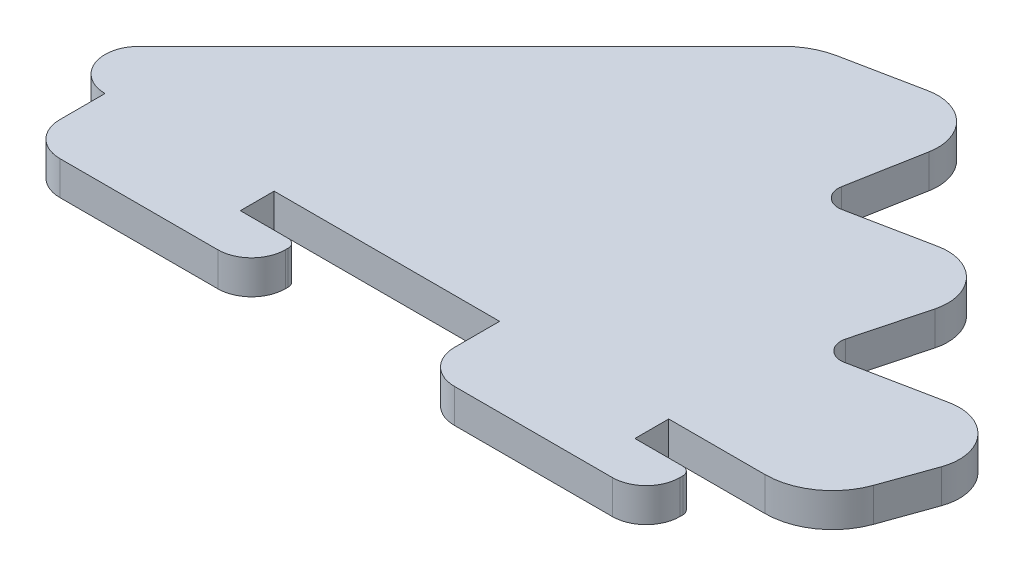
ISO-10303-21;
HEADER;
FILE_DESCRIPTION(('STEP AP214'),'2;1');
FILE_NAME('part.step','',(''),(''),'','','');
FILE_SCHEMA(('AUTOMOTIVE_DESIGN { 1 0 10303 214 1 1 1 1 }'));
ENDSEC;
DATA;
#1=APPLICATION_CONTEXT('core data for automotive mechanical design processes');
#2=APPLICATION_PROTOCOL_DEFINITION('international standard','automotive_design',2000,#1);
#3=PRODUCT_CONTEXT('',#1,'mechanical');
#4=PRODUCT('Part','Part','',(#3));
#5=PRODUCT_RELATED_PRODUCT_CATEGORY('part','',(#4));
#6=PRODUCT_DEFINITION_FORMATION('','',#4);
#7=PRODUCT_DEFINITION_CONTEXT('part definition',#1,'design');
#8=PRODUCT_DEFINITION('design','',#6,#7);
#9=PRODUCT_DEFINITION_SHAPE('','',#8);
#10=(LENGTH_UNIT() NAMED_UNIT(*) SI_UNIT(.MILLI.,.METRE.));
#11=(NAMED_UNIT(*) PLANE_ANGLE_UNIT() SI_UNIT($,.RADIAN.));
#12=(NAMED_UNIT(*) SI_UNIT($,.STERADIAN.) SOLID_ANGLE_UNIT());
#13=UNCERTAINTY_MEASURE_WITH_UNIT(LENGTH_MEASURE(1.E-05),#10,'distance_accuracy_value','');
#14=(GEOMETRIC_REPRESENTATION_CONTEXT(3) GLOBAL_UNCERTAINTY_ASSIGNED_CONTEXT((#13)) GLOBAL_UNIT_ASSIGNED_CONTEXT((#10,
#11,#12)) REPRESENTATION_CONTEXT('',''));
#15=CARTESIAN_POINT('',(0.,0.,0.));
#16=DIRECTION('',(0.,0.,1.));
#17=DIRECTION('',(1.,0.,0.));
#18=AXIS2_PLACEMENT_3D('',#15,#16,#17);
#19=CARTESIAN_POINT('',(69.2418774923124,3.,-9.7772198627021));
#20=DIRECTION('',(0.,-1.,0.));
#21=DIRECTION('',(0.,0.,-1.));
#22=AXIS2_PLACEMENT_3D('',#19,#20,#21);
#23=CYLINDRICAL_SURFACE('',#22,4.00000000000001);
#24=CARTESIAN_POINT('',(69.2418774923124,0.,-9.7772198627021));
#25=DIRECTION('',(0.,1.,0.));
#26=DIRECTION('',(0.,0.,-1.));
#27=AXIS2_PLACEMENT_3D('',#24,#25,#26);
#28=CIRCLE('',#27,4.00000000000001);
#29=CARTESIAN_POINT('',(73.0092042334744,0.,-8.43288016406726));
#30=VERTEX_POINT('',#29);
#31=CARTESIAN_POINT('',(68.4538781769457,0.,-13.6988339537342));
#32=VERTEX_POINT('',#31);
#33=EDGE_CURVE('E279',#30,#32,#28,.T.);
#34=ORIENTED_EDGE('',*,*,#33,.T.);
#35=DIRECTION('',(0.,-1.,0.));
#36=VECTOR('',#35,1.);
#37=CARTESIAN_POINT('',(68.4538781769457,3.,-13.6988339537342));
#38=LINE('',#37,#36);
#39=CARTESIAN_POINT('',(68.4538781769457,3.,-13.6988339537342));
#40=VERTEX_POINT('',#39);
#41=EDGE_CURVE('E258',#40,#32,#38,.T.);
#42=ORIENTED_EDGE('',*,*,#41,.F.);
#43=CARTESIAN_POINT('',(69.2418774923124,3.,-9.7772198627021));
#44=DIRECTION('',(0.,1.,0.));
#45=DIRECTION('',(0.,0.,-1.));
#46=AXIS2_PLACEMENT_3D('',#43,#44,#45);
#47=CIRCLE('',#46,4.00000000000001);
#48=CARTESIAN_POINT('',(73.0092042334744,3.,-8.43288016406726));
#49=VERTEX_POINT('',#48);
#50=EDGE_CURVE('E265',#49,#40,#47,.T.);
#51=ORIENTED_EDGE('',*,*,#50,.F.);
#52=DIRECTION('',(0.,-1.,0.));
#53=VECTOR('',#52,1.);
#54=CARTESIAN_POINT('',(73.0092042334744,3.,-8.43288016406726));
#55=LINE('',#54,#53);
#56=EDGE_CURVE('E421',#49,#30,#55,.T.);
#57=ORIENTED_EDGE('',*,*,#56,.T.);
#58=EDGE_LOOP('',(#34,#42,#51,#57));
#59=FACE_BOUND('',#58,.T.);
#60=ADVANCED_FACE('F38',(#59),#23,.T.);
#61=CARTESIAN_POINT('',(60.6919456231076,3.,-12.1391706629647));
#62=DIRECTION('',(0.196999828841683,0.,0.980403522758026));
#63=DIRECTION('',(0.980403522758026,0.,-0.196999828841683));
#64=AXIS2_PLACEMENT_3D('',#61,#62,#63);
#65=PLANE('',#64);
#66=DIRECTION('',(-0.980403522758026,0.,0.196999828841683));
#67=VECTOR('',#66,1.);
#68=CARTESIAN_POINT('',(60.6919456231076,0.,-12.1391706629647));
#69=LINE('',#68,#67);
#70=CARTESIAN_POINT('',(60.6919456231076,0.,-12.1391706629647));
#71=VERTEX_POINT('',#70);
#72=EDGE_CURVE('E513',#32,#71,#69,.T.);
#73=ORIENTED_EDGE('',*,*,#72,.T.);
#74=DIRECTION('',(0.,-1.,0.));
#75=VECTOR('',#74,1.);
#76=CARTESIAN_POINT('',(60.6919456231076,3.,-12.1391706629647));
#77=LINE('',#76,#75);
#78=CARTESIAN_POINT('',(60.6919456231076,3.,-12.1391706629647));
#79=VERTEX_POINT('',#78);
#80=EDGE_CURVE('E261',#79,#71,#77,.T.);
#81=ORIENTED_EDGE('',*,*,#80,.F.);
#82=DIRECTION('',(-0.980403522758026,0.,0.196999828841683));
#83=VECTOR('',#82,1.);
#84=CARTESIAN_POINT('',(60.6919456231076,3.,-12.1391706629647));
#85=LINE('',#84,#83);
#86=EDGE_CURVE('E254',#40,#79,#85,.T.);
#87=ORIENTED_EDGE('',*,*,#86,.F.);
#88=ORIENTED_EDGE('',*,*,#41,.T.);
#89=EDGE_LOOP('',(#73,#81,#87,#88));
#90=FACE_BOUND('',#89,.T.);
#91=ADVANCED_FACE('F256',(#90),#65,.F.);
#92=CARTESIAN_POINT('',(60.396445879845,3.,-13.6097759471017));
#93=DIRECTION('',(0.,-1.,0.));
#94=DIRECTION('',(0.,0.,-1.));
#95=AXIS2_PLACEMENT_3D('',#92,#93,#94);
#96=CYLINDRICAL_SURFACE('',#95,1.49999999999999);
#97=CARTESIAN_POINT('',(60.396445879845,0.,-13.6097759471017));
#98=DIRECTION('',(0.,-1.,0.));
#99=DIRECTION('',(0.,0.,-1.));
#100=AXIS2_PLACEMENT_3D('',#97,#98,#99);
#101=CIRCLE('',#100,1.49999999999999);
#102=CARTESIAN_POINT('',(58.9457105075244,0.,-13.9910460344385));
#103=VERTEX_POINT('',#102);
#104=EDGE_CURVE('E504',#71,#103,#101,.T.);
#105=ORIENTED_EDGE('',*,*,#104,.T.);
#106=DIRECTION('',(0.,-1.,0.));
#107=VECTOR('',#106,1.);
#108=CARTESIAN_POINT('',(58.9457105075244,3.,-13.9910460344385));
#109=LINE('',#108,#107);
#110=CARTESIAN_POINT('',(58.9457105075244,3.,-13.9910460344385));
#111=VERTEX_POINT('',#110);
#112=EDGE_CURVE('E288',#111,#103,#109,.T.);
#113=ORIENTED_EDGE('',*,*,#112,.F.);
#114=CARTESIAN_POINT('',(60.396445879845,3.,-13.6097759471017));
#115=DIRECTION('',(0.,-1.,0.));
#116=DIRECTION('',(0.,0.,-1.));
#117=AXIS2_PLACEMENT_3D('',#114,#115,#116);
#118=CIRCLE('',#117,1.49999999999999);
#119=EDGE_CURVE('E264',#79,#111,#118,.T.);
#120=ORIENTED_EDGE('',*,*,#119,.F.);
#121=ORIENTED_EDGE('',*,*,#80,.T.);
#122=EDGE_LOOP('',(#105,#113,#120,#121));
#123=FACE_BOUND('',#122,.T.);
#124=ADVANCED_FACE('F596',(#123),#96,.F.);
#125=CARTESIAN_POINT('',(60.5924233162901,3.,-20.2567998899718));
#126=DIRECTION('',(-0.967156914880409,0.,-0.254180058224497));
#127=DIRECTION('',(-0.254180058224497,0.,0.967156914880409));
#128=AXIS2_PLACEMENT_3D('',#125,#126,#127);
#129=PLANE('',#128);
#130=DIRECTION('',(0.254180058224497,0.,-0.967156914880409));
#131=VECTOR('',#130,1.);
#132=CARTESIAN_POINT('',(60.5924233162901,0.,-20.2567998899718));
#133=LINE('',#132,#131);
#134=CARTESIAN_POINT('',(60.5924233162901,0.,-20.2567998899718));
#135=VERTEX_POINT('',#134);
#136=EDGE_CURVE('E499',#103,#135,#133,.T.);
#137=ORIENTED_EDGE('',*,*,#136,.T.);
#138=DIRECTION('',(0.,-1.,0.));
#139=VECTOR('',#138,1.);
#140=CARTESIAN_POINT('',(60.5924233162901,3.,-20.2567998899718));
#141=LINE('',#140,#139);
#142=CARTESIAN_POINT('',(60.5924233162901,3.,-20.2567998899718));
#143=VERTEX_POINT('',#142);
#144=EDGE_CURVE('E488',#143,#135,#141,.T.);
#145=ORIENTED_EDGE('',*,*,#144,.F.);
#146=DIRECTION('',(0.254180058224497,0.,-0.967156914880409));
#147=VECTOR('',#146,1.);
#148=CARTESIAN_POINT('',(60.5924233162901,3.,-20.2567998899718));
#149=LINE('',#148,#147);
#150=EDGE_CURVE('E500',#111,#143,#149,.T.);
#151=ORIENTED_EDGE('',*,*,#150,.F.);
#152=ORIENTED_EDGE('',*,*,#112,.T.);
#153=EDGE_LOOP('',(#137,#145,#151,#152));
#154=FACE_BOUND('',#153,.T.);
#155=ADVANCED_FACE('F497',(#154),#129,.F.);
#156=CARTESIAN_POINT('',(56.7237956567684,3.,-21.2735201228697));
#157=DIRECTION('',(0.,-1.,0.));
#158=DIRECTION('',(0.,0.,-1.));
#159=AXIS2_PLACEMENT_3D('',#156,#157,#158);
#160=CYLINDRICAL_SURFACE('',#159,4.);
#161=CARTESIAN_POINT('',(56.7237956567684,0.,-21.2735201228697));
#162=DIRECTION('',(0.,1.,0.));
#163=DIRECTION('',(0.,0.,-1.));
#164=AXIS2_PLACEMENT_3D('',#161,#162,#163);
#165=CIRCLE('',#164,4.);
#166=CARTESIAN_POINT('',(55.9357963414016,0.,-25.1951342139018));
#167=VERTEX_POINT('',#166);
#168=EDGE_CURVE('E506',#135,#167,#165,.T.);
#169=ORIENTED_EDGE('',*,*,#168,.T.);
#170=DIRECTION('',(0.,-1.,0.));
#171=VECTOR('',#170,1.);
#172=CARTESIAN_POINT('',(55.9357963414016,3.,-25.1951342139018));
#173=LINE('',#172,#171);
#174=CARTESIAN_POINT('',(55.9357963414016,3.,-25.1951342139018));
#175=VERTEX_POINT('',#174);
#176=EDGE_CURVE('E484',#175,#167,#173,.T.);
#177=ORIENTED_EDGE('',*,*,#176,.F.);
#178=CARTESIAN_POINT('',(56.7237956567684,3.,-21.2735201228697));
#179=DIRECTION('',(0.,1.,0.));
#180=DIRECTION('',(0.,0.,-1.));
#181=AXIS2_PLACEMENT_3D('',#178,#179,#180);
#182=CIRCLE('',#181,4.);
#183=EDGE_CURVE('E600',#143,#175,#182,.T.);
#184=ORIENTED_EDGE('',*,*,#183,.F.);
#185=ORIENTED_EDGE('',*,*,#144,.T.);
#186=EDGE_LOOP('',(#169,#177,#184,#185));
#187=FACE_BOUND('',#186,.T.);
#188=ADVANCED_FACE('F658',(#187),#160,.T.);
#189=CARTESIAN_POINT('',(48.8358164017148,3.,-23.7684820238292));
#190=DIRECTION('',(0.196999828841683,0.,0.980403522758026));
#191=DIRECTION('',(0.980403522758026,0.,-0.196999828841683));
#192=AXIS2_PLACEMENT_3D('',#189,#190,#191);
#193=PLANE('',#192);
#194=DIRECTION('',(-0.980403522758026,0.,0.196999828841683));
#195=VECTOR('',#194,1.);
#196=CARTESIAN_POINT('',(48.8358164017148,0.,-23.7684820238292));
#197=LINE('',#196,#195);
#198=CARTESIAN_POINT('',(48.8358164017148,0.,-23.7684820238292));
#199=VERTEX_POINT('',#198);
#200=EDGE_CURVE('E511',#167,#199,#197,.T.);
#201=ORIENTED_EDGE('',*,*,#200,.T.);
#202=DIRECTION('',(0.,-1.,0.));
#203=VECTOR('',#202,1.);
#204=CARTESIAN_POINT('',(48.8358164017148,3.,-23.7684820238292));
#205=LINE('',#204,#203);
#206=CARTESIAN_POINT('',(48.8358164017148,3.,-23.7684820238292));
#207=VERTEX_POINT('',#206);
#208=EDGE_CURVE('E480',#207,#199,#205,.T.);
#209=ORIENTED_EDGE('',*,*,#208,.F.);
#210=DIRECTION('',(-0.980403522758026,0.,0.196999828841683));
#211=VECTOR('',#210,1.);
#212=CARTESIAN_POINT('',(48.8358164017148,3.,-23.7684820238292));
#213=LINE('',#212,#211);
#214=EDGE_CURVE('E605',#175,#207,#213,.T.);
#215=ORIENTED_EDGE('',*,*,#214,.F.);
#216=ORIENTED_EDGE('',*,*,#176,.T.);
#217=EDGE_LOOP('',(#201,#209,#215,#216));
#218=FACE_BOUND('',#217,.T.);
#219=ADVANCED_FACE('F654',(#218),#193,.F.);
#220=CARTESIAN_POINT('',(48.5403166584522,3.,-25.2390873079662));
#221=DIRECTION('',(0.,-1.,0.));
#222=DIRECTION('',(0.,0.,-1.));
#223=AXIS2_PLACEMENT_3D('',#220,#221,#222);
#224=CYLINDRICAL_SURFACE('',#223,1.5);
#225=CARTESIAN_POINT('',(48.5403166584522,0.,-25.2390873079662));
#226=DIRECTION('',(0.,-1.,0.));
#227=DIRECTION('',(0.,0.,1.));
#228=AXIS2_PLACEMENT_3D('',#225,#226,#227);
#229=CIRCLE('',#228,1.5);
#230=CARTESIAN_POINT('',(47.0647336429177,0.,-25.5086327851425));
#231=VERTEX_POINT('',#230);
#232=EDGE_CURVE('E519',#199,#231,#229,.T.);
#233=ORIENTED_EDGE('',*,*,#232,.T.);
#234=DIRECTION('',(0.,-1.,0.));
#235=VECTOR('',#234,1.);
#236=CARTESIAN_POINT('',(47.0647336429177,3.,-25.5086327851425));
#237=LINE('',#236,#235);
#238=CARTESIAN_POINT('',(47.0647336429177,3.,-25.5086327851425));
#239=VERTEX_POINT('',#238);
#240=EDGE_CURVE('E476',#239,#231,#237,.T.);
#241=ORIENTED_EDGE('',*,*,#240,.F.);
#242=CARTESIAN_POINT('',(48.5403166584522,3.,-25.2390873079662));
#243=DIRECTION('',(0.,-1.,0.));
#244=DIRECTION('',(0.,0.,1.));
#245=AXIS2_PLACEMENT_3D('',#242,#243,#244);
#246=CIRCLE('',#245,1.5);
#247=EDGE_CURVE('E608',#207,#239,#246,.T.);
#248=ORIENTED_EDGE('',*,*,#247,.F.);
#249=ORIENTED_EDGE('',*,*,#208,.T.);
#250=EDGE_LOOP('',(#233,#241,#248,#249));
#251=FACE_BOUND('',#250,.T.);
#252=ADVANCED_FACE('F650',(#251),#224,.F.);
#253=CARTESIAN_POINT('',(48.2643803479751,3.,-32.0759041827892));
#254=DIRECTION('',(-0.983722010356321,0.,-0.179696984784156));
#255=DIRECTION('',(-0.179696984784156,0.,0.983722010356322));
#256=AXIS2_PLACEMENT_3D('',#253,#254,#255);
#257=PLANE('',#256);
#258=DIRECTION('',(0.179696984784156,0.,-0.983722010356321));
#259=VECTOR('',#258,1.);
#260=CARTESIAN_POINT('',(48.2643803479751,0.,-32.0759041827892));
#261=LINE('',#260,#259);
#262=CARTESIAN_POINT('',(48.2643803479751,0.,-32.0759041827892));
#263=VERTEX_POINT('',#262);
#264=EDGE_CURVE('E522',#231,#263,#261,.T.);
#265=ORIENTED_EDGE('',*,*,#264,.T.);
#266=DIRECTION('',(0.,-1.,0.));
#267=VECTOR('',#266,1.);
#268=CARTESIAN_POINT('',(48.2643803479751,3.,-32.0759041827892));
#269=LINE('',#268,#267);
#270=CARTESIAN_POINT('',(48.2643803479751,3.,-32.0759041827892));
#271=VERTEX_POINT('',#270);
#272=EDGE_CURVE('E472',#271,#263,#269,.T.);
#273=ORIENTED_EDGE('',*,*,#272,.F.);
#274=DIRECTION('',(0.179696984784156,0.,-0.983722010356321));
#275=VECTOR('',#274,1.);
#276=CARTESIAN_POINT('',(48.2643803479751,3.,-32.0759041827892));
#277=LINE('',#276,#275);
#278=EDGE_CURVE('E611',#239,#271,#277,.T.);
#279=ORIENTED_EDGE('',*,*,#278,.F.);
#280=ORIENTED_EDGE('',*,*,#240,.T.);
#281=EDGE_LOOP('',(#265,#273,#279,#280));
#282=FACE_BOUND('',#281,.T.);
#283=ADVANCED_FACE('F645',(#282),#257,.F.);
#284=CARTESIAN_POINT('',(44.3294923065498,3.,-32.7946921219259));
#285=DIRECTION('',(0.,-1.,0.));
#286=DIRECTION('',(0.,0.,-1.));
#287=AXIS2_PLACEMENT_3D('',#284,#285,#286);
#288=CYLINDRICAL_SURFACE('',#287,4.);
#289=CARTESIAN_POINT('',(44.3294923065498,0.,-32.7946921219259));
#290=DIRECTION('',(0.,1.,0.));
#291=DIRECTION('',(0.,0.,-1.));
#292=AXIS2_PLACEMENT_3D('',#289,#290,#291);
#293=CIRCLE('',#292,4.);
#294=CARTESIAN_POINT('',(43.541492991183,0.,-36.716306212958));
#295=VERTEX_POINT('',#294);
#296=EDGE_CURVE('E525',#263,#295,#293,.T.);
#297=ORIENTED_EDGE('',*,*,#296,.T.);
#298=DIRECTION('',(0.,-1.,0.));
#299=VECTOR('',#298,1.);
#300=CARTESIAN_POINT('',(43.541492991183,3.,-36.716306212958));
#301=LINE('',#300,#299);
#302=CARTESIAN_POINT('',(43.541492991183,3.,-36.716306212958));
#303=VERTEX_POINT('',#302);
#304=EDGE_CURVE('E468',#303,#295,#301,.T.);
#305=ORIENTED_EDGE('',*,*,#304,.F.);
#306=CARTESIAN_POINT('',(44.3294923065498,3.,-32.7946921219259));
#307=DIRECTION('',(0.,1.,0.));
#308=DIRECTION('',(0.,0.,-1.));
#309=AXIS2_PLACEMENT_3D('',#306,#307,#308);
#310=CIRCLE('',#309,4.);
#311=EDGE_CURVE('E614',#271,#303,#310,.T.);
#312=ORIENTED_EDGE('',*,*,#311,.F.);
#313=ORIENTED_EDGE('',*,*,#272,.T.);
#314=EDGE_LOOP('',(#297,#305,#312,#313));
#315=FACE_BOUND('',#314,.T.);
#316=ADVANCED_FACE('F640',(#315),#288,.T.);
#317=CARTESIAN_POINT('',(36.7781603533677,3.,-35.3572990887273));
#318=DIRECTION('',(0.196999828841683,0.,0.980403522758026));
#319=DIRECTION('',(0.980403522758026,0.,-0.196999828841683));
#320=AXIS2_PLACEMENT_3D('',#317,#318,#319);
#321=PLANE('',#320);
#322=DIRECTION('',(-0.980403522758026,0.,0.196999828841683));
#323=VECTOR('',#322,1.);
#324=CARTESIAN_POINT('',(36.7781603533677,0.,-35.3572990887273));
#325=LINE('',#324,#323);
#326=CARTESIAN_POINT('',(36.7781603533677,0.,-35.3572990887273));
#327=VERTEX_POINT('',#326);
#328=EDGE_CURVE('E528',#295,#327,#325,.T.);
#329=ORIENTED_EDGE('',*,*,#328,.T.);
#330=DIRECTION('',(0.,-1.,0.));
#331=VECTOR('',#330,1.);
#332=CARTESIAN_POINT('',(36.7781603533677,3.,-35.3572990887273));
#333=LINE('',#332,#331);
#334=CARTESIAN_POINT('',(36.7781603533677,3.,-35.3572990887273));
#335=VERTEX_POINT('',#334);
#336=EDGE_CURVE('E464',#335,#327,#333,.T.);
#337=ORIENTED_EDGE('',*,*,#336,.F.);
#338=DIRECTION('',(-0.980403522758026,0.,0.196999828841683));
#339=VECTOR('',#338,1.);
#340=CARTESIAN_POINT('',(36.7781603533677,3.,-35.3572990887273));
#341=LINE('',#340,#339);
#342=EDGE_CURVE('E617',#303,#335,#341,.T.);
#343=ORIENTED_EDGE('',*,*,#342,.F.);
#344=ORIENTED_EDGE('',*,*,#304,.T.);
#345=EDGE_LOOP('',(#329,#337,#343,#344));
#346=FACE_BOUND('',#345,.T.);
#347=ADVANCED_FACE('F636',(#346),#321,.F.);
#348=CARTESIAN_POINT('',(37.9601593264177,3.,-29.4748779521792));
#349=DIRECTION('',(0.,-1.,0.));
#350=DIRECTION('',(0.,0.,-1.));
#351=AXIS2_PLACEMENT_3D('',#348,#349,#350);
#352=CYLINDRICAL_SURFACE('',#351,6.);
#353=CARTESIAN_POINT('',(37.9601593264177,0.,-29.4748779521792));
#354=DIRECTION('',(0.,1.,0.));
#355=DIRECTION('',(0.,0.,-1.));
#356=AXIS2_PLACEMENT_3D('',#353,#354,#355);
#357=CIRCLE('',#356,6.);
#358=CARTESIAN_POINT('',(33.7175186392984,0.,-33.7175186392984));
#359=VERTEX_POINT('',#358);
#360=EDGE_CURVE('E531',#327,#359,#357,.T.);
#361=ORIENTED_EDGE('',*,*,#360,.T.);
#362=DIRECTION('',(0.,-1.,0.));
#363=VECTOR('',#362,1.);
#364=CARTESIAN_POINT('',(33.7175186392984,3.,-33.7175186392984));
#365=LINE('',#364,#363);
#366=CARTESIAN_POINT('',(33.7175186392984,3.,-33.7175186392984));
#367=VERTEX_POINT('',#366);
#368=EDGE_CURVE('E460',#367,#359,#365,.T.);
#369=ORIENTED_EDGE('',*,*,#368,.F.);
#370=CARTESIAN_POINT('',(37.9601593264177,3.,-29.4748779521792));
#371=DIRECTION('',(0.,1.,0.));
#372=DIRECTION('',(0.,0.,-1.));
#373=AXIS2_PLACEMENT_3D('',#370,#371,#372);
#374=CIRCLE('',#373,6.);
#375=EDGE_CURVE('E620',#335,#367,#374,.T.);
#376=ORIENTED_EDGE('',*,*,#375,.F.);
#377=ORIENTED_EDGE('',*,*,#336,.T.);
#378=EDGE_LOOP('',(#361,#369,#376,#377));
#379=FACE_BOUND('',#378,.T.);
#380=ADVANCED_FACE('F632',(#379),#352,.T.);
#381=CARTESIAN_POINT('',(33.7175186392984,3.,-33.7175186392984));
#382=DIRECTION('',(0.707106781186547,0.,0.707106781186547));
#383=DIRECTION('',(0.707106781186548,0.,-0.707106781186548));
#384=AXIS2_PLACEMENT_3D('',#381,#382,#383);
#385=PLANE('',#384);
#386=DIRECTION('',(-0.707106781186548,0.,0.707106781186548));
#387=VECTOR('',#386,1.);
#388=CARTESIAN_POINT('',(33.7175186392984,0.,-33.7175186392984));
#389=LINE('',#388,#387);
#390=CARTESIAN_POINT('',(5.12132034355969,0.,-5.12132034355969));
#391=VERTEX_POINT('',#390);
#392=EDGE_CURVE('E534',#359,#391,#389,.T.);
#393=ORIENTED_EDGE('',*,*,#392,.T.);
#394=DIRECTION('',(0.,-1.,0.));
#395=VECTOR('',#394,1.);
#396=CARTESIAN_POINT('',(5.12132034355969,3.,-5.12132034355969));
#397=LINE('',#396,#395);
#398=CARTESIAN_POINT('',(5.12132034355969,3.,-5.12132034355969));
#399=VERTEX_POINT('',#398);
#400=EDGE_CURVE('E456',#399,#391,#397,.T.);
#401=ORIENTED_EDGE('',*,*,#400,.F.);
#402=DIRECTION('',(-0.707106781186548,0.,0.707106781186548));
#403=VECTOR('',#402,1.);
#404=CARTESIAN_POINT('',(33.7175186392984,3.,-33.7175186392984));
#405=LINE('',#404,#403);
#406=EDGE_CURVE('E554',#367,#399,#405,.T.);
#407=ORIENTED_EDGE('',*,*,#406,.F.);
#408=ORIENTED_EDGE('',*,*,#368,.T.);
#409=EDGE_LOOP('',(#393,#401,#407,#408));
#410=FACE_BOUND('',#409,.T.);
#411=ADVANCED_FACE('F627',(#410),#385,.F.);
#412=CARTESIAN_POINT('',(7.24264068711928,3.,-3.));
#413=DIRECTION('',(0.,-1.,0.));
#414=DIRECTION('',(0.,0.,-1.));
#415=AXIS2_PLACEMENT_3D('',#412,#413,#414);
#416=CYLINDRICAL_SURFACE('',#415,3.);
#417=CARTESIAN_POINT('',(7.24264068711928,0.,-3.));
#418=DIRECTION('',(0.,1.,0.));
#419=DIRECTION('',(0.,0.,-1.));
#420=AXIS2_PLACEMENT_3D('',#417,#418,#419);
#421=CIRCLE('',#420,3.);
#422=CARTESIAN_POINT('',(7.24264068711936,0.,0.));
#423=VERTEX_POINT('',#422);
#424=EDGE_CURVE('E383',#391,#423,#421,.T.);
#425=ORIENTED_EDGE('',*,*,#424,.T.);
#426=DIRECTION('',(0.,-1.,0.));
#427=VECTOR('',#426,1.);
#428=CARTESIAN_POINT('',(7.24264068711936,3.,0.));
#429=LINE('',#428,#427);
#430=CARTESIAN_POINT('',(7.24264068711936,3.,0.));
#431=VERTEX_POINT('',#430);
#432=EDGE_CURVE('E452',#431,#423,#429,.T.);
#433=ORIENTED_EDGE('',*,*,#432,.F.);
#434=CARTESIAN_POINT('',(7.24264068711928,3.,-3.));
#435=DIRECTION('',(0.,1.,0.));
#436=DIRECTION('',(0.,0.,-1.));
#437=AXIS2_PLACEMENT_3D('',#434,#435,#436);
#438=CIRCLE('',#437,3.);
#439=EDGE_CURVE('E548',#399,#431,#438,.T.);
#440=ORIENTED_EDGE('',*,*,#439,.F.);
#441=ORIENTED_EDGE('',*,*,#400,.T.);
#442=EDGE_LOOP('',(#425,#433,#440,#441));
#443=FACE_BOUND('',#442,.T.);
#444=ADVANCED_FACE('F541',(#443),#416,.T.);
#445=CARTESIAN_POINT('',(7.24264068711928,3.,3.));
#446=DIRECTION('',(1.,0.,0.));
#447=DIRECTION('',(0.,0.,-1.));
#448=AXIS2_PLACEMENT_3D('',#445,#446,#447);
#449=PLANE('',#448);
#450=DIRECTION('',(0.,0.,1.));
#451=VECTOR('',#450,1.);
#452=CARTESIAN_POINT('',(7.24264068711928,0.,3.));
#453=LINE('',#452,#451);
#454=CARTESIAN_POINT('',(7.24264068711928,0.,4.));
#455=VERTEX_POINT('',#454);
#456=EDGE_CURVE('E376',#423,#455,#453,.T.);
#457=ORIENTED_EDGE('',*,*,#456,.T.);
#458=DIRECTION('',(0.,-1.,0.));
#459=VECTOR('',#458,1.);
#460=CARTESIAN_POINT('',(7.24264068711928,3.,4.));
#461=LINE('',#460,#459);
#462=CARTESIAN_POINT('',(7.24264068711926,3.,4.));
#463=VERTEX_POINT('',#462);
#464=EDGE_CURVE('E11',#455,#463,#461,.F.);
#465=ORIENTED_EDGE('',*,*,#464,.T.);
#466=DIRECTION('',(0.,0.,1.));
#467=VECTOR('',#466,1.);
#468=CARTESIAN_POINT('',(7.24264068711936,3.,0.));
#469=LINE('',#468,#467);
#470=EDGE_CURVE('E546',#431,#463,#469,.T.);
#471=ORIENTED_EDGE('',*,*,#470,.F.);
#472=ORIENTED_EDGE('',*,*,#432,.T.);
#473=EDGE_LOOP('',(#457,#465,#471,#472));
#474=FACE_BOUND('',#473,.T.);
#475=ADVANCED_FACE('F545',(#474),#449,.F.);
#476=CARTESIAN_POINT('',(7.24264068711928,3.,7.));
#477=DIRECTION('',(0.,0.,-1.));
#478=DIRECTION('',(-1.,0.,0.));
#479=AXIS2_PLACEMENT_3D('',#476,#477,#478);
#480=PLANE('',#479);
#481=DIRECTION('',(1.,0.,0.));
#482=VECTOR('',#481,1.);
#483=CARTESIAN_POINT('',(7.24264068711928,3.,7.));
#484=LINE('',#483,#482);
#485=CARTESIAN_POINT('',(10.2426406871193,3.,7.));
#486=VERTEX_POINT('',#485);
#487=CARTESIAN_POINT('',(24.2426406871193,3.,7.));
#488=VERTEX_POINT('',#487);
#489=EDGE_CURVE('E367',#486,#488,#484,.T.);
#490=ORIENTED_EDGE('',*,*,#489,.F.);
#491=DIRECTION('',(0.,-1.,0.));
#492=VECTOR('',#491,1.);
#493=CARTESIAN_POINT('',(10.2426406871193,3.,7.));
#494=LINE('',#493,#492);
#495=CARTESIAN_POINT('',(10.2426406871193,0.,7.));
#496=VERTEX_POINT('',#495);
#497=EDGE_CURVE('E47',#486,#496,#494,.T.);
#498=ORIENTED_EDGE('',*,*,#497,.T.);
#499=DIRECTION('',(1.,0.,0.));
#500=VECTOR('',#499,1.);
#501=CARTESIAN_POINT('',(7.24264068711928,0.,7.));
#502=LINE('',#501,#500);
#503=CARTESIAN_POINT('',(24.2426406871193,0.,7.));
#504=VERTEX_POINT('',#503);
#505=EDGE_CURVE('E366',#496,#504,#502,.T.);
#506=ORIENTED_EDGE('',*,*,#505,.T.);
#507=DIRECTION('',(0.,-1.,0.));
#508=VECTOR('',#507,1.);
#509=CARTESIAN_POINT('',(24.2426406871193,3.,7.));
#510=LINE('',#509,#508);
#511=EDGE_CURVE('E313',#504,#488,#510,.F.);
#512=ORIENTED_EDGE('',*,*,#511,.T.);
#513=EDGE_LOOP('',(#490,#498,#506,#512));
#514=FACE_BOUND('',#513,.T.);
#515=ADVANCED_FACE('F365',(#514),#480,.F.);
#516=CARTESIAN_POINT('',(27.2426406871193,3.,3.));
#517=DIRECTION('',(-1.,0.,0.));
#518=DIRECTION('',(0.,0.,1.));
#519=AXIS2_PLACEMENT_3D('',#516,#517,#518);
#520=PLANE('',#519);
#521=DIRECTION('',(0.,0.,-1.));
#522=VECTOR('',#521,1.);
#523=CARTESIAN_POINT('',(27.2426406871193,0.,3.));
#524=LINE('',#523,#522);
#525=CARTESIAN_POINT('',(27.2426406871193,0.,4.));
#526=VERTEX_POINT('',#525);
#527=CARTESIAN_POINT('',(27.2426406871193,0.,3.75));
#528=VERTEX_POINT('',#527);
#529=EDGE_CURVE('E375',#526,#528,#524,.T.);
#530=ORIENTED_EDGE('',*,*,#529,.T.);
#531=DIRECTION('',(0.,-1.,0.));
#532=VECTOR('',#531,1.);
#533=CARTESIAN_POINT('',(27.2426406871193,3.,3.75));
#534=LINE('',#533,#532);
#535=CARTESIAN_POINT('',(27.2426406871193,3.,3.75));
#536=VERTEX_POINT('',#535);
#537=EDGE_CURVE('E340',#528,#536,#534,.F.);
#538=ORIENTED_EDGE('',*,*,#537,.T.);
#539=DIRECTION('',(0.,0.,-1.));
#540=VECTOR('',#539,1.);
#541=CARTESIAN_POINT('',(27.2426406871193,3.,3.));
#542=LINE('',#541,#540);
#543=CARTESIAN_POINT('',(27.2426406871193,3.,4.));
#544=VERTEX_POINT('',#543);
#545=EDGE_CURVE('E552',#544,#536,#542,.T.);
#546=ORIENTED_EDGE('',*,*,#545,.F.);
#547=DIRECTION('',(0.,-1.,0.));
#548=VECTOR('',#547,1.);
#549=CARTESIAN_POINT('',(27.2426406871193,3.,4.));
#550=LINE('',#549,#548);
#551=EDGE_CURVE('E309',#544,#526,#550,.T.);
#552=ORIENTED_EDGE('',*,*,#551,.T.);
#553=EDGE_LOOP('',(#530,#538,#546,#552));
#554=FACE_BOUND('',#553,.T.);
#555=ADVANCED_FACE('F757',(#554),#520,.F.);
#556=CARTESIAN_POINT('',(22.2426406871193,3.,3.));
#557=DIRECTION('',(0.,0.,1.));
#558=DIRECTION('',(1.,0.,0.));
#559=AXIS2_PLACEMENT_3D('',#556,#557,#558);
#560=PLANE('',#559);
#561=DIRECTION('',(-1.,0.,0.));
#562=VECTOR('',#561,1.);
#563=CARTESIAN_POINT('',(22.2426406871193,3.,3.));
#564=LINE('',#563,#562);
#565=CARTESIAN_POINT('',(26.4926406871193,3.,3.));
#566=VERTEX_POINT('',#565);
#567=CARTESIAN_POINT('',(22.2426406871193,3.,3.));
#568=VERTEX_POINT('',#567);
#569=EDGE_CURVE('E561',#566,#568,#564,.T.);
#570=ORIENTED_EDGE('',*,*,#569,.F.);
#571=DIRECTION('',(0.,-1.,0.));
#572=VECTOR('',#571,1.);
#573=CARTESIAN_POINT('',(26.4926406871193,3.,3.));
#574=LINE('',#573,#572);
#575=CARTESIAN_POINT('',(26.4926406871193,0.,3.));
#576=VERTEX_POINT('',#575);
#577=EDGE_CURVE('E336',#566,#576,#574,.T.);
#578=ORIENTED_EDGE('',*,*,#577,.T.);
#579=DIRECTION('',(-1.,0.,0.));
#580=VECTOR('',#579,1.);
#581=CARTESIAN_POINT('',(22.2426406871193,0.,3.));
#582=LINE('',#581,#580);
#583=CARTESIAN_POINT('',(22.2426406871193,0.,3.));
#584=VERTEX_POINT('',#583);
#585=EDGE_CURVE('E381',#576,#584,#582,.T.);
#586=ORIENTED_EDGE('',*,*,#585,.T.);
#587=DIRECTION('',(0.,-1.,0.));
#588=VECTOR('',#587,1.);
#589=CARTESIAN_POINT('',(22.2426406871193,3.,3.));
#590=LINE('',#589,#588);
#591=EDGE_CURVE('E448',#568,#584,#590,.T.);
#592=ORIENTED_EDGE('',*,*,#591,.F.);
#593=EDGE_LOOP('',(#570,#578,#586,#592));
#594=FACE_BOUND('',#593,.T.);
#595=ADVANCED_FACE('F752',(#594),#560,.F.);
#596=CARTESIAN_POINT('',(22.2426406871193,3.,0.));
#597=DIRECTION('',(-1.,0.,0.));
#598=DIRECTION('',(0.,0.,1.));
#599=AXIS2_PLACEMENT_3D('',#596,#597,#598);
#600=PLANE('',#599);
#601=DIRECTION('',(0.,0.,-1.));
#602=VECTOR('',#601,1.);
#603=CARTESIAN_POINT('',(22.2426406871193,0.,0.));
#604=LINE('',#603,#602);
#605=CARTESIAN_POINT('',(22.2426406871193,0.,0.));
#606=VERTEX_POINT('',#605);
#607=EDGE_CURVE('E389',#584,#606,#604,.T.);
#608=ORIENTED_EDGE('',*,*,#607,.T.);
#609=DIRECTION('',(0.,-1.,0.));
#610=VECTOR('',#609,1.);
#611=CARTESIAN_POINT('',(22.2426406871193,3.,0.));
#612=LINE('',#611,#610);
#613=CARTESIAN_POINT('',(22.2426406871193,3.,0.));
#614=VERTEX_POINT('',#613);
#615=EDGE_CURVE('E444',#614,#606,#612,.T.);
#616=ORIENTED_EDGE('',*,*,#615,.F.);
#617=DIRECTION('',(0.,0.,-1.));
#618=VECTOR('',#617,1.);
#619=CARTESIAN_POINT('',(22.2426406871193,3.,0.));
#620=LINE('',#619,#618);
#621=EDGE_CURVE('E564',#568,#614,#620,.T.);
#622=ORIENTED_EDGE('',*,*,#621,.F.);
#623=ORIENTED_EDGE('',*,*,#591,.T.);
#624=EDGE_LOOP('',(#608,#616,#622,#623));
#625=FACE_BOUND('',#624,.T.);
#626=ADVANCED_FACE('F747',(#625),#600,.F.);
#627=CARTESIAN_POINT('',(22.2426406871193,3.,0.));
#628=DIRECTION('',(0.,0.,-1.));
#629=DIRECTION('',(-1.,0.,0.));
#630=AXIS2_PLACEMENT_3D('',#627,#628,#629);
#631=PLANE('',#630);
#632=DIRECTION('',(1.,0.,0.));
#633=VECTOR('',#632,1.);
#634=CARTESIAN_POINT('',(22.2426406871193,0.,0.));
#635=LINE('',#634,#633);
#636=CARTESIAN_POINT('',(42.2426406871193,0.,0.));
#637=VERTEX_POINT('',#636);
#638=EDGE_CURVE('E392',#606,#637,#635,.T.);
#639=ORIENTED_EDGE('',*,*,#638,.T.);
#640=DIRECTION('',(0.,-1.,0.));
#641=VECTOR('',#640,1.);
#642=CARTESIAN_POINT('',(42.2426406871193,3.,0.));
#643=LINE('',#642,#641);
#644=CARTESIAN_POINT('',(42.2426406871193,3.,0.));
#645=VERTEX_POINT('',#644);
#646=EDGE_CURVE('E440',#645,#637,#643,.T.);
#647=ORIENTED_EDGE('',*,*,#646,.F.);
#648=DIRECTION('',(1.,0.,0.));
#649=VECTOR('',#648,1.);
#650=CARTESIAN_POINT('',(22.2426406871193,3.,0.));
#651=LINE('',#650,#649);
#652=EDGE_CURVE('E567',#614,#645,#651,.T.);
#653=ORIENTED_EDGE('',*,*,#652,.F.);
#654=ORIENTED_EDGE('',*,*,#615,.T.);
#655=EDGE_LOOP('',(#639,#647,#653,#654));
#656=FACE_BOUND('',#655,.T.);
#657=ADVANCED_FACE('F742',(#656),#631,.F.);
#658=CARTESIAN_POINT('',(42.2426406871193,3.,3.));
#659=DIRECTION('',(1.,0.,0.));
#660=DIRECTION('',(0.,0.,-1.));
#661=AXIS2_PLACEMENT_3D('',#658,#659,#660);
#662=PLANE('',#661);
#663=DIRECTION('',(0.,0.,1.));
#664=VECTOR('',#663,1.);
#665=CARTESIAN_POINT('',(42.2426406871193,0.,3.));
#666=LINE('',#665,#664);
#667=CARTESIAN_POINT('',(42.2426406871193,0.,4.));
#668=VERTEX_POINT('',#667);
#669=EDGE_CURVE('E396',#637,#668,#666,.T.);
#670=ORIENTED_EDGE('',*,*,#669,.T.);
#671=DIRECTION('',(0.,-1.,0.));
#672=VECTOR('',#671,1.);
#673=CARTESIAN_POINT('',(42.2426406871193,3.,4.));
#674=LINE('',#673,#672);
#675=CARTESIAN_POINT('',(42.2426406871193,3.,4.));
#676=VERTEX_POINT('',#675);
#677=EDGE_CURVE('E353',#668,#676,#674,.F.);
#678=ORIENTED_EDGE('',*,*,#677,.T.);
#679=DIRECTION('',(0.,0.,1.));
#680=VECTOR('',#679,1.);
#681=CARTESIAN_POINT('',(42.2426406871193,3.,0.));
#682=LINE('',#681,#680);
#683=EDGE_CURVE('E570',#645,#676,#682,.T.);
#684=ORIENTED_EDGE('',*,*,#683,.F.);
#685=ORIENTED_EDGE('',*,*,#646,.T.);
#686=EDGE_LOOP('',(#670,#678,#684,#685));
#687=FACE_BOUND('',#686,.T.);
#688=ADVANCED_FACE('F738',(#687),#662,.F.);
#689=CARTESIAN_POINT('',(42.2426406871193,3.,7.));
#690=DIRECTION('',(0.,0.,-1.));
#691=DIRECTION('',(-1.,0.,0.));
#692=AXIS2_PLACEMENT_3D('',#689,#690,#691);
#693=PLANE('',#692);
#694=DIRECTION('',(1.,0.,0.));
#695=VECTOR('',#694,1.);
#696=CARTESIAN_POINT('',(42.2426406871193,3.,7.));
#697=LINE('',#696,#695);
#698=CARTESIAN_POINT('',(45.2426406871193,3.,7.));
#699=VERTEX_POINT('',#698);
#700=CARTESIAN_POINT('',(59.2426406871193,3.,7.));
#701=VERTEX_POINT('',#700);
#702=EDGE_CURVE('E573',#699,#701,#697,.T.);
#703=ORIENTED_EDGE('',*,*,#702,.F.);
#704=DIRECTION('',(0.,-1.,0.));
#705=VECTOR('',#704,1.);
#706=CARTESIAN_POINT('',(45.2426406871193,3.,7.));
#707=LINE('',#706,#705);
#708=CARTESIAN_POINT('',(45.2426406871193,0.,7.));
#709=VERTEX_POINT('',#708);
#710=EDGE_CURVE('E343',#699,#709,#707,.T.);
#711=ORIENTED_EDGE('',*,*,#710,.T.);
#712=DIRECTION('',(1.,0.,0.));
#713=VECTOR('',#712,1.);
#714=CARTESIAN_POINT('',(42.2426406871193,0.,7.));
#715=LINE('',#714,#713);
#716=CARTESIAN_POINT('',(59.2426406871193,0.,7.));
#717=VERTEX_POINT('',#716);
#718=EDGE_CURVE('E400',#709,#717,#715,.T.);
#719=ORIENTED_EDGE('',*,*,#718,.T.);
#720=DIRECTION('',(0.,-1.,0.));
#721=VECTOR('',#720,1.);
#722=CARTESIAN_POINT('',(59.2426406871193,3.,7.));
#723=LINE('',#722,#721);
#724=EDGE_CURVE('E299',#717,#701,#723,.F.);
#725=ORIENTED_EDGE('',*,*,#724,.T.);
#726=EDGE_LOOP('',(#703,#711,#719,#725));
#727=FACE_BOUND('',#726,.T.);
#728=ADVANCED_FACE('F702',(#727),#693,.F.);
#729=CARTESIAN_POINT('',(62.2426406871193,3.,3.));
#730=DIRECTION('',(-1.,0.,0.));
#731=DIRECTION('',(0.,0.,1.));
#732=AXIS2_PLACEMENT_3D('',#729,#730,#731);
#733=PLANE('',#732);
#734=DIRECTION('',(0.,0.,-1.));
#735=VECTOR('',#734,1.);
#736=CARTESIAN_POINT('',(62.2426406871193,0.,3.));
#737=LINE('',#736,#735);
#738=CARTESIAN_POINT('',(62.2426406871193,0.,4.));
#739=VERTEX_POINT('',#738);
#740=CARTESIAN_POINT('',(62.2426406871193,0.,3.75));
#741=VERTEX_POINT('',#740);
#742=EDGE_CURVE('E403',#739,#741,#737,.T.);
#743=ORIENTED_EDGE('',*,*,#742,.T.);
#744=DIRECTION('',(0.,-1.,0.));
#745=VECTOR('',#744,1.);
#746=CARTESIAN_POINT('',(62.2426406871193,3.,3.75));
#747=LINE('',#746,#745);
#748=CARTESIAN_POINT('',(62.2426406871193,3.,3.75));
#749=VERTEX_POINT('',#748);
#750=EDGE_CURVE('E327',#741,#749,#747,.F.);
#751=ORIENTED_EDGE('',*,*,#750,.T.);
#752=DIRECTION('',(0.,0.,-1.));
#753=VECTOR('',#752,1.);
#754=CARTESIAN_POINT('',(62.2426406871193,3.,3.));
#755=LINE('',#754,#753);
#756=CARTESIAN_POINT('',(62.2426406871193,3.,4.));
#757=VERTEX_POINT('',#756);
#758=EDGE_CURVE('E576',#757,#749,#755,.T.);
#759=ORIENTED_EDGE('',*,*,#758,.F.);
#760=DIRECTION('',(0.,-1.,0.));
#761=VECTOR('',#760,1.);
#762=CARTESIAN_POINT('',(62.2426406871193,3.,4.));
#763=LINE('',#762,#761);
#764=EDGE_CURVE('E281',#757,#739,#763,.T.);
#765=ORIENTED_EDGE('',*,*,#764,.T.);
#766=EDGE_LOOP('',(#743,#751,#759,#765));
#767=FACE_BOUND('',#766,.T.);
#768=ADVANCED_FACE('F709',(#767),#733,.F.);
#769=CARTESIAN_POINT('',(57.2426406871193,3.,3.));
#770=DIRECTION('',(0.,0.,1.));
#771=DIRECTION('',(1.,0.,0.));
#772=AXIS2_PLACEMENT_3D('',#769,#770,#771);
#773=PLANE('',#772);
#774=DIRECTION('',(-1.,0.,0.));
#775=VECTOR('',#774,1.);
#776=CARTESIAN_POINT('',(57.2426406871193,3.,3.));
#777=LINE('',#776,#775);
#778=CARTESIAN_POINT('',(61.4926406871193,3.,3.));
#779=VERTEX_POINT('',#778);
#780=CARTESIAN_POINT('',(57.2426406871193,3.,3.));
#781=VERTEX_POINT('',#780);
#782=EDGE_CURVE('E580',#779,#781,#777,.T.);
#783=ORIENTED_EDGE('',*,*,#782,.F.);
#784=DIRECTION('',(0.,-1.,0.));
#785=VECTOR('',#784,1.);
#786=CARTESIAN_POINT('',(61.4926406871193,3.,3.));
#787=LINE('',#786,#785);
#788=CARTESIAN_POINT('',(61.4926406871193,0.,3.));
#789=VERTEX_POINT('',#788);
#790=EDGE_CURVE('E317',#779,#789,#787,.T.);
#791=ORIENTED_EDGE('',*,*,#790,.T.);
#792=DIRECTION('',(-1.,0.,0.));
#793=VECTOR('',#792,1.);
#794=CARTESIAN_POINT('',(57.2426406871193,0.,3.));
#795=LINE('',#794,#793);
#796=CARTESIAN_POINT('',(57.2426406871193,0.,3.));
#797=VERTEX_POINT('',#796);
#798=EDGE_CURVE('E407',#789,#797,#795,.T.);
#799=ORIENTED_EDGE('',*,*,#798,.T.);
#800=DIRECTION('',(0.,-1.,0.));
#801=VECTOR('',#800,1.);
#802=CARTESIAN_POINT('',(57.2426406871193,3.,3.));
#803=LINE('',#802,#801);
#804=EDGE_CURVE('E436',#781,#797,#803,.T.);
#805=ORIENTED_EDGE('',*,*,#804,.F.);
#806=EDGE_LOOP('',(#783,#791,#799,#805));
#807=FACE_BOUND('',#806,.T.);
#808=ADVANCED_FACE('F716',(#807),#773,.F.);
#809=CARTESIAN_POINT('',(57.2426406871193,3.,0.));
#810=DIRECTION('',(-1.,0.,0.));
#811=DIRECTION('',(0.,0.,1.));
#812=AXIS2_PLACEMENT_3D('',#809,#810,#811);
#813=PLANE('',#812);
#814=DIRECTION('',(0.,0.,-1.));
#815=VECTOR('',#814,1.);
#816=CARTESIAN_POINT('',(57.2426406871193,0.,0.));
#817=LINE('',#816,#815);
#818=CARTESIAN_POINT('',(57.2426406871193,0.,0.));
#819=VERTEX_POINT('',#818);
#820=EDGE_CURVE('E410',#797,#819,#817,.T.);
#821=ORIENTED_EDGE('',*,*,#820,.T.);
#822=DIRECTION('',(0.,-1.,0.));
#823=VECTOR('',#822,1.);
#824=CARTESIAN_POINT('',(57.2426406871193,3.,0.));
#825=LINE('',#824,#823);
#826=CARTESIAN_POINT('',(57.2426406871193,3.,0.));
#827=VERTEX_POINT('',#826);
#828=EDGE_CURVE('E432',#827,#819,#825,.T.);
#829=ORIENTED_EDGE('',*,*,#828,.F.);
#830=DIRECTION('',(0.,0.,-1.));
#831=VECTOR('',#830,1.);
#832=CARTESIAN_POINT('',(57.2426406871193,3.,0.));
#833=LINE('',#832,#831);
#834=EDGE_CURVE('E583',#781,#827,#833,.T.);
#835=ORIENTED_EDGE('',*,*,#834,.F.);
#836=ORIENTED_EDGE('',*,*,#804,.T.);
#837=EDGE_LOOP('',(#821,#829,#835,#836));
#838=FACE_BOUND('',#837,.T.);
#839=ADVANCED_FACE('F722',(#838),#813,.F.);
#840=CARTESIAN_POINT('',(57.2426406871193,3.,0.));
#841=DIRECTION('',(0.,0.,-1.));
#842=DIRECTION('',(-1.,0.,0.));
#843=AXIS2_PLACEMENT_3D('',#840,#841,#842);
#844=PLANE('',#843);
#845=DIRECTION('',(1.,0.,0.));
#846=VECTOR('',#845,1.);
#847=CARTESIAN_POINT('',(57.2426406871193,0.,0.));
#848=LINE('',#847,#846);
#849=CARTESIAN_POINT('',(65.7704858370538,0.,0.));
#850=VERTEX_POINT('',#849);
#851=EDGE_CURVE('E413',#819,#850,#848,.T.);
#852=ORIENTED_EDGE('',*,*,#851,.T.);
#853=DIRECTION('',(0.,-1.,0.));
#854=VECTOR('',#853,1.);
#855=CARTESIAN_POINT('',(65.7704858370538,3.,0.));
#856=LINE('',#855,#854);
#857=CARTESIAN_POINT('',(65.7704858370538,3.,0.));
#858=VERTEX_POINT('',#857);
#859=EDGE_CURVE('E428',#858,#850,#856,.T.);
#860=ORIENTED_EDGE('',*,*,#859,.F.);
#861=DIRECTION('',(1.,0.,0.));
#862=VECTOR('',#861,1.);
#863=CARTESIAN_POINT('',(57.2426406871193,3.,0.));
#864=LINE('',#863,#862);
#865=EDGE_CURVE('E586',#827,#858,#864,.T.);
#866=ORIENTED_EDGE('',*,*,#865,.F.);
#867=ORIENTED_EDGE('',*,*,#828,.T.);
#868=EDGE_LOOP('',(#852,#860,#866,#867));
#869=FACE_BOUND('',#868,.T.);
#870=ADVANCED_FACE('F728',(#869),#844,.F.);
#871=CARTESIAN_POINT('',(65.7704858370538,3.,-6.));
#872=DIRECTION('',(0.,-1.,0.));
#873=DIRECTION('',(0.,0.,-1.));
#874=AXIS2_PLACEMENT_3D('',#871,#872,#873);
#875=CYLINDRICAL_SURFACE('',#874,5.99999999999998);
#876=CARTESIAN_POINT('',(65.7704858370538,0.,-6.));
#877=DIRECTION('',(0.,1.,0.));
#878=DIRECTION('',(0.,0.,1.));
#879=AXIS2_PLACEMENT_3D('',#876,#877,#878);
#880=CIRCLE('',#879,5.99999999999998);
#881=CARTESIAN_POINT('',(71.4214759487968,0.,-3.9834904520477));
#882=VERTEX_POINT('',#881);
#883=EDGE_CURVE('E416',#850,#882,#880,.T.);
#884=ORIENTED_EDGE('',*,*,#883,.T.);
#885=DIRECTION('',(0.,-1.,0.));
#886=VECTOR('',#885,1.);
#887=CARTESIAN_POINT('',(71.4214759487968,3.,-3.9834904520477));
#888=LINE('',#887,#886);
#889=CARTESIAN_POINT('',(71.4214759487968,3.,-3.9834904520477));
#890=VERTEX_POINT('',#889);
#891=EDGE_CURVE('E424',#890,#882,#888,.T.);
#892=ORIENTED_EDGE('',*,*,#891,.F.);
#893=CARTESIAN_POINT('',(65.7704858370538,3.,-6.));
#894=DIRECTION('',(0.,1.,0.));
#895=DIRECTION('',(0.,0.,1.));
#896=AXIS2_PLACEMENT_3D('',#893,#894,#895);
#897=CIRCLE('',#896,5.99999999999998);
#898=EDGE_CURVE('E589',#858,#890,#897,.T.);
#899=ORIENTED_EDGE('',*,*,#898,.F.);
#900=ORIENTED_EDGE('',*,*,#859,.T.);
#901=EDGE_LOOP('',(#884,#892,#899,#900));
#902=FACE_BOUND('',#901,.T.);
#903=ADVANCED_FACE('F732',(#902),#875,.T.);
#904=CARTESIAN_POINT('',(73.0092042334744,3.,-8.43288016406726));
#905=DIRECTION('',(-0.9418316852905,0.,-0.336084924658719));
#906=DIRECTION('',(-0.336084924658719,0.,0.9418316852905));
#907=AXIS2_PLACEMENT_3D('',#904,#905,#906);
#908=PLANE('',#907);
#909=DIRECTION('',(0.336084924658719,0.,-0.9418316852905));
#910=VECTOR('',#909,1.);
#911=CARTESIAN_POINT('',(73.0092042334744,0.,-8.43288016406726));
#912=LINE('',#911,#910);
#913=EDGE_CURVE('E276',#882,#30,#912,.T.);
#914=ORIENTED_EDGE('',*,*,#913,.T.);
#915=ORIENTED_EDGE('',*,*,#56,.F.);
#916=DIRECTION('',(0.336084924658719,0.,-0.9418316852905));
#917=VECTOR('',#916,1.);
#918=CARTESIAN_POINT('',(73.0092042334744,3.,-8.43288016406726));
#919=LINE('',#918,#917);
#920=EDGE_CURVE('E271',#890,#49,#919,.T.);
#921=ORIENTED_EDGE('',*,*,#920,.F.);
#922=ORIENTED_EDGE('',*,*,#891,.T.);
#923=EDGE_LOOP('',(#914,#915,#921,#922));
#924=FACE_BOUND('',#923,.T.);
#925=ADVANCED_FACE('F735',(#924),#908,.F.);
#926=CARTESIAN_POINT('',(69.2418774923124,3.,-9.7772198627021));
#927=DIRECTION('',(0.,-1.,0.));
#928=DIRECTION('',(0.,0.,-1.));
#929=AXIS2_PLACEMENT_3D('',#926,#927,#928);
#930=PLANE('',#929);
#931=ORIENTED_EDGE('',*,*,#683,.T.);
#932=CARTESIAN_POINT('',(45.2426406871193,3.,4.));
#933=DIRECTION('',(0.,-1.,0.));
#934=DIRECTION('',(0.,0.,-1.));
#935=AXIS2_PLACEMENT_3D('',#932,#933,#934);
#936=CIRCLE('',#935,3.);
#937=EDGE_CURVE('E358',#676,#699,#936,.F.);
#938=ORIENTED_EDGE('',*,*,#937,.T.);
#939=ORIENTED_EDGE('',*,*,#702,.T.);
#940=CARTESIAN_POINT('',(59.2426406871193,3.,4.));
#941=DIRECTION('',(0.,-1.,0.));
#942=DIRECTION('',(0.,0.,-1.));
#943=AXIS2_PLACEMENT_3D('',#940,#941,#942);
#944=CIRCLE('',#943,3.);
#945=EDGE_CURVE('E306',#701,#757,#944,.F.);
#946=ORIENTED_EDGE('',*,*,#945,.T.);
#947=ORIENTED_EDGE('',*,*,#758,.T.);
#948=CARTESIAN_POINT('',(61.4926406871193,3.,3.75));
#949=DIRECTION('',(0.,-1.,0.));
#950=DIRECTION('',(0.,0.,-1.));
#951=AXIS2_PLACEMENT_3D('',#948,#949,#950);
#952=CIRCLE('',#951,0.75);
#953=EDGE_CURVE('E333',#749,#779,#952,.F.);
#954=ORIENTED_EDGE('',*,*,#953,.T.);
#955=ORIENTED_EDGE('',*,*,#782,.T.);
#956=ORIENTED_EDGE('',*,*,#834,.T.);
#957=ORIENTED_EDGE('',*,*,#865,.T.);
#958=ORIENTED_EDGE('',*,*,#898,.T.);
#959=ORIENTED_EDGE('',*,*,#920,.T.);
#960=ORIENTED_EDGE('',*,*,#50,.T.);
#961=ORIENTED_EDGE('',*,*,#86,.T.);
#962=ORIENTED_EDGE('',*,*,#119,.T.);
#963=ORIENTED_EDGE('',*,*,#150,.T.);
#964=ORIENTED_EDGE('',*,*,#183,.T.);
#965=ORIENTED_EDGE('',*,*,#214,.T.);
#966=ORIENTED_EDGE('',*,*,#247,.T.);
#967=ORIENTED_EDGE('',*,*,#278,.T.);
#968=ORIENTED_EDGE('',*,*,#311,.T.);
#969=ORIENTED_EDGE('',*,*,#342,.T.);
#970=ORIENTED_EDGE('',*,*,#375,.T.);
#971=ORIENTED_EDGE('',*,*,#406,.T.);
#972=ORIENTED_EDGE('',*,*,#439,.T.);
#973=ORIENTED_EDGE('',*,*,#470,.T.);
#974=CARTESIAN_POINT('',(10.2426406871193,3.,4.));
#975=DIRECTION('',(0.,-1.,0.));
#976=DIRECTION('',(0.,0.,-1.));
#977=AXIS2_PLACEMENT_3D('',#974,#975,#976);
#978=CIRCLE('',#977,3.);
#979=EDGE_CURVE('E54',#463,#486,#978,.F.);
#980=ORIENTED_EDGE('',*,*,#979,.T.);
#981=ORIENTED_EDGE('',*,*,#489,.T.);
#982=CARTESIAN_POINT('',(24.2426406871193,3.,4.));
#983=DIRECTION('',(0.,-1.,0.));
#984=DIRECTION('',(0.,0.,-1.));
#985=AXIS2_PLACEMENT_3D('',#982,#983,#984);
#986=CIRCLE('',#985,3.);
#987=EDGE_CURVE('E303',#488,#544,#986,.F.);
#988=ORIENTED_EDGE('',*,*,#987,.T.);
#989=ORIENTED_EDGE('',*,*,#545,.T.);
#990=CARTESIAN_POINT('',(26.4926406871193,3.,3.75));
#991=DIRECTION('',(0.,-1.,0.));
#992=DIRECTION('',(0.,0.,-1.));
#993=AXIS2_PLACEMENT_3D('',#990,#991,#992);
#994=CIRCLE('',#993,0.75);
#995=EDGE_CURVE('E330',#536,#566,#994,.F.);
#996=ORIENTED_EDGE('',*,*,#995,.T.);
#997=ORIENTED_EDGE('',*,*,#569,.T.);
#998=ORIENTED_EDGE('',*,*,#621,.T.);
#999=ORIENTED_EDGE('',*,*,#652,.T.);
#1000=EDGE_LOOP('',(#931,#938,#939,#946,#947,#954,#955,#956,#957,#958,#959,#960,#961,#962,#963,
#964,#965,#966,#967,#968,#969,#970,#971,#972,#973,#980,#981,#988,#989,#996,#997,#998,#999));
#1001=FACE_BOUND('',#1000,.T.);
#1002=ADVANCED_FACE('F269',(#1001),#930,.F.);
#1003=CARTESIAN_POINT('',(69.2418774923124,0.,-9.7772198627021));
#1004=DIRECTION('',(0.,-1.,0.));
#1005=DIRECTION('',(0.,0.,-1.));
#1006=AXIS2_PLACEMENT_3D('',#1003,#1004,#1005);
#1007=PLANE('',#1006);
#1008=ORIENTED_EDGE('',*,*,#718,.F.);
#1009=CARTESIAN_POINT('',(45.2426406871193,0.,4.));
#1010=DIRECTION('',(0.,-1.,0.));
#1011=DIRECTION('',(0.,0.,-1.));
#1012=AXIS2_PLACEMENT_3D('',#1009,#1010,#1011);
#1013=CIRCLE('',#1012,3.);
#1014=EDGE_CURVE('E350',#709,#668,#1013,.T.);
#1015=ORIENTED_EDGE('',*,*,#1014,.T.);
#1016=ORIENTED_EDGE('',*,*,#669,.F.);
#1017=ORIENTED_EDGE('',*,*,#638,.F.);
#1018=ORIENTED_EDGE('',*,*,#607,.F.);
#1019=ORIENTED_EDGE('',*,*,#585,.F.);
#1020=CARTESIAN_POINT('',(26.4926406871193,0.,3.75));
#1021=DIRECTION('',(0.,-1.,0.));
#1022=DIRECTION('',(0.,0.,-1.));
#1023=AXIS2_PLACEMENT_3D('',#1020,#1021,#1022);
#1024=CIRCLE('',#1023,0.75);
#1025=EDGE_CURVE('E321',#576,#528,#1024,.T.);
#1026=ORIENTED_EDGE('',*,*,#1025,.T.);
#1027=ORIENTED_EDGE('',*,*,#529,.F.);
#1028=CARTESIAN_POINT('',(24.2426406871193,0.,4.));
#1029=DIRECTION('',(0.,-1.,0.));
#1030=DIRECTION('',(0.,0.,-1.));
#1031=AXIS2_PLACEMENT_3D('',#1028,#1029,#1030);
#1032=CIRCLE('',#1031,3.);
#1033=EDGE_CURVE('E286',#526,#504,#1032,.T.);
#1034=ORIENTED_EDGE('',*,*,#1033,.T.);
#1035=ORIENTED_EDGE('',*,*,#505,.F.);
#1036=CARTESIAN_POINT('',(10.2426406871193,0.,4.));
#1037=DIRECTION('',(0.,-1.,0.));
#1038=DIRECTION('',(0.,0.,-1.));
#1039=AXIS2_PLACEMENT_3D('',#1036,#1037,#1038);
#1040=CIRCLE('',#1039,3.);
#1041=EDGE_CURVE('E347',#496,#455,#1040,.T.);
#1042=ORIENTED_EDGE('',*,*,#1041,.T.);
#1043=ORIENTED_EDGE('',*,*,#456,.F.);
#1044=ORIENTED_EDGE('',*,*,#424,.F.);
#1045=ORIENTED_EDGE('',*,*,#392,.F.);
#1046=ORIENTED_EDGE('',*,*,#360,.F.);
#1047=ORIENTED_EDGE('',*,*,#328,.F.);
#1048=ORIENTED_EDGE('',*,*,#296,.F.);
#1049=ORIENTED_EDGE('',*,*,#264,.F.);
#1050=ORIENTED_EDGE('',*,*,#232,.F.);
#1051=ORIENTED_EDGE('',*,*,#200,.F.);
#1052=ORIENTED_EDGE('',*,*,#168,.F.);
#1053=ORIENTED_EDGE('',*,*,#136,.F.);
#1054=ORIENTED_EDGE('',*,*,#104,.F.);
#1055=ORIENTED_EDGE('',*,*,#72,.F.);
#1056=ORIENTED_EDGE('',*,*,#33,.F.);
#1057=ORIENTED_EDGE('',*,*,#913,.F.);
#1058=ORIENTED_EDGE('',*,*,#883,.F.);
#1059=ORIENTED_EDGE('',*,*,#851,.F.);
#1060=ORIENTED_EDGE('',*,*,#820,.F.);
#1061=ORIENTED_EDGE('',*,*,#798,.F.);
#1062=CARTESIAN_POINT('',(61.4926406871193,0.,3.75));
#1063=DIRECTION('',(0.,-1.,0.));
#1064=DIRECTION('',(0.,0.,-1.));
#1065=AXIS2_PLACEMENT_3D('',#1062,#1063,#1064);
#1066=CIRCLE('',#1065,0.75);
#1067=EDGE_CURVE('E324',#789,#741,#1066,.T.);
#1068=ORIENTED_EDGE('',*,*,#1067,.T.);
#1069=ORIENTED_EDGE('',*,*,#742,.F.);
#1070=CARTESIAN_POINT('',(59.2426406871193,0.,4.));
#1071=DIRECTION('',(0.,-1.,0.));
#1072=DIRECTION('',(0.,0.,-1.));
#1073=AXIS2_PLACEMENT_3D('',#1070,#1071,#1072);
#1074=CIRCLE('',#1073,3.);
#1075=EDGE_CURVE('E295',#739,#717,#1074,.T.);
#1076=ORIENTED_EDGE('',*,*,#1075,.T.);
#1077=EDGE_LOOP('',(#1008,#1015,#1016,#1017,#1018,#1019,#1026,#1027,#1034,#1035,#1042,#1043,
#1044,#1045,#1046,#1047,#1048,#1049,#1050,#1051,#1052,#1053,#1054,#1055,#1056,#1057,#1058,#1059,
#1060,#1061,#1068,#1069,#1076));
#1078=FACE_BOUND('',#1077,.T.);
#1079=ADVANCED_FACE('F371',(#1078),#1007,.T.);
#1080=CARTESIAN_POINT('',(59.2426406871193,3.,4.));
#1081=DIRECTION('',(0.,-1.,0.));
#1082=DIRECTION('',(0.,0.,-1.));
#1083=AXIS2_PLACEMENT_3D('',#1080,#1081,#1082);
#1084=CYLINDRICAL_SURFACE('',#1083,3.);
#1085=ORIENTED_EDGE('',*,*,#945,.F.);
#1086=ORIENTED_EDGE('',*,*,#724,.F.);
#1087=ORIENTED_EDGE('',*,*,#1075,.F.);
#1088=ORIENTED_EDGE('',*,*,#764,.F.);
#1089=EDGE_LOOP('',(#1085,#1086,#1087,#1088));
#1090=FACE_BOUND('',#1089,.T.);
#1091=ADVANCED_FACE('F675',(#1090),#1084,.T.);
#1092=CARTESIAN_POINT('',(24.2426406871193,3.,4.));
#1093=DIRECTION('',(0.,-1.,0.));
#1094=DIRECTION('',(0.,0.,-1.));
#1095=AXIS2_PLACEMENT_3D('',#1092,#1093,#1094);
#1096=CYLINDRICAL_SURFACE('',#1095,3.);
#1097=ORIENTED_EDGE('',*,*,#987,.F.);
#1098=ORIENTED_EDGE('',*,*,#511,.F.);
#1099=ORIENTED_EDGE('',*,*,#1033,.F.);
#1100=ORIENTED_EDGE('',*,*,#551,.F.);
#1101=EDGE_LOOP('',(#1097,#1098,#1099,#1100));
#1102=FACE_BOUND('',#1101,.T.);
#1103=ADVANCED_FACE('F678',(#1102),#1096,.T.);
#1104=CARTESIAN_POINT('',(61.4926406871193,3.,3.75));
#1105=DIRECTION('',(0.,-1.,0.));
#1106=DIRECTION('',(0.,0.,-1.));
#1107=AXIS2_PLACEMENT_3D('',#1104,#1105,#1106);
#1108=CYLINDRICAL_SURFACE('',#1107,0.75);
#1109=ORIENTED_EDGE('',*,*,#953,.F.);
#1110=ORIENTED_EDGE('',*,*,#750,.F.);
#1111=ORIENTED_EDGE('',*,*,#1067,.F.);
#1112=ORIENTED_EDGE('',*,*,#790,.F.);
#1113=EDGE_LOOP('',(#1109,#1110,#1111,#1112));
#1114=FACE_BOUND('',#1113,.T.);
#1115=ADVANCED_FACE('F682',(#1114),#1108,.T.);
#1116=CARTESIAN_POINT('',(26.4926406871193,3.,3.75));
#1117=DIRECTION('',(0.,-1.,0.));
#1118=DIRECTION('',(0.,0.,-1.));
#1119=AXIS2_PLACEMENT_3D('',#1116,#1117,#1118);
#1120=CYLINDRICAL_SURFACE('',#1119,0.75);
#1121=ORIENTED_EDGE('',*,*,#995,.F.);
#1122=ORIENTED_EDGE('',*,*,#537,.F.);
#1123=ORIENTED_EDGE('',*,*,#1025,.F.);
#1124=ORIENTED_EDGE('',*,*,#577,.F.);
#1125=EDGE_LOOP('',(#1121,#1122,#1123,#1124));
#1126=FACE_BOUND('',#1125,.T.);
#1127=ADVANCED_FACE('F686',(#1126),#1120,.T.);
#1128=CARTESIAN_POINT('',(45.2426406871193,3.,4.));
#1129=DIRECTION('',(0.,-1.,0.));
#1130=DIRECTION('',(0.,0.,-1.));
#1131=AXIS2_PLACEMENT_3D('',#1128,#1129,#1130);
#1132=CYLINDRICAL_SURFACE('',#1131,3.);
#1133=ORIENTED_EDGE('',*,*,#937,.F.);
#1134=ORIENTED_EDGE('',*,*,#677,.F.);
#1135=ORIENTED_EDGE('',*,*,#1014,.F.);
#1136=ORIENTED_EDGE('',*,*,#710,.F.);
#1137=EDGE_LOOP('',(#1133,#1134,#1135,#1136));
#1138=FACE_BOUND('',#1137,.T.);
#1139=ADVANCED_FACE('F689',(#1138),#1132,.T.);
#1140=CARTESIAN_POINT('',(10.2426406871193,3.,4.));
#1141=DIRECTION('',(0.,-1.,0.));
#1142=DIRECTION('',(0.,0.,-1.));
#1143=AXIS2_PLACEMENT_3D('',#1140,#1141,#1142);
#1144=CYLINDRICAL_SURFACE('',#1143,3.);
#1145=ORIENTED_EDGE('',*,*,#979,.F.);
#1146=ORIENTED_EDGE('',*,*,#464,.F.);
#1147=ORIENTED_EDGE('',*,*,#1041,.F.);
#1148=ORIENTED_EDGE('',*,*,#497,.F.);
#1149=EDGE_LOOP('',(#1145,#1146,#1147,#1148));
#1150=FACE_BOUND('',#1149,.T.);
#1151=ADVANCED_FACE('F40',(#1150),#1144,.T.);
#1152=CLOSED_SHELL('',(#60,#91,#124,#155,#188,#219,#252,#283,#316,#347,#380,#411,#444,#475,#515,
#555,#595,#626,#657,#688,#728,#768,#808,#839,#870,#903,#925,#1002,#1079,#1091,#1103,#1115,#1127,
#1139,#1151));
#1153=MANIFOLD_SOLID_BREP('B2',#1152);
#1154=ADVANCED_BREP_SHAPE_REPRESENTATION('',(#18,#1153),#14);
#1155=SHAPE_DEFINITION_REPRESENTATION(#9,#1154);
ENDSEC;
END-ISO-10303-21;
